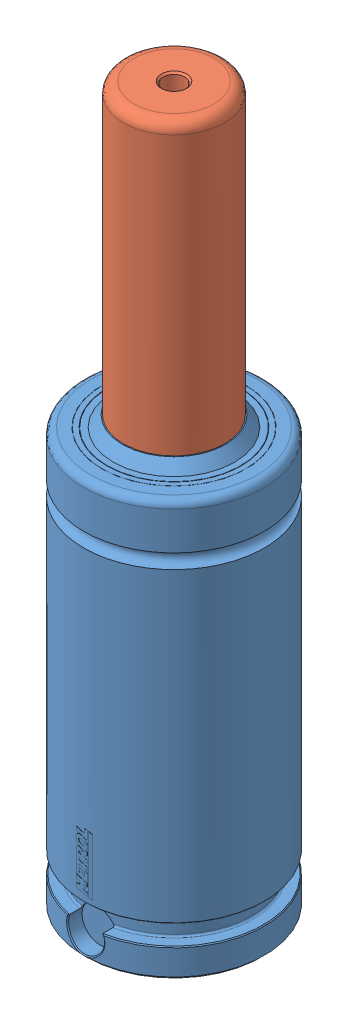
SolidWorks assembly EX1000-080.SLDASM, configuration Default (file format 7000). Lengths in mm.
Overall size (50 198 50.1).
2 component instances, 2 part files, 5 mates.
Components (placement in the parent):
- EX-1000 Body-1: EX-1000 Body.SLDPRT [EX-1000-080] x (0 0 1) z (0 -1 0) size (50.1 50 118)
- EX-1000 Piston-1: EX-1000 Piston.SLDPRT [EX-1000-080] at (0 100 0) x (0.173563 0 -0.984823) z (0 -1 0) size (40 40 98)
Mates (geometry in assembly coordinates):
- Concentric1: concentric aligned: cylinder of EX-1000 Body-1 through (0 0 0) axis (0 -1 0) radius 14; cylinder of EX-1000 Piston-1 through (0 100 0) axis (0 -1 0) radius 14
- LimitDistance1: limit distance anti-aligned: plane of EX-1000 Piston-1 through (19.6965 105 3.4713) normal (0 1 0); plane of EX-1000 Body-1 through (-14 105 0) normal (0 -1 0)
- Coincident1: coincident anti-aligned: plane of EX-1000 Body-1 through (0 0 0) normal (0 -1 0); plane of assembly through (0 0 0) normal (0 1 0)
- Coincident2: coincident aligned: plane of EX-1000 Body-1; plane of assembly through (0 0 0) normal (0 0 1)
- Coincident3: coincident anti-aligned: plane of EX-1000 Body-1; plane of assembly through (0 0 0) normal (1 0 0)
